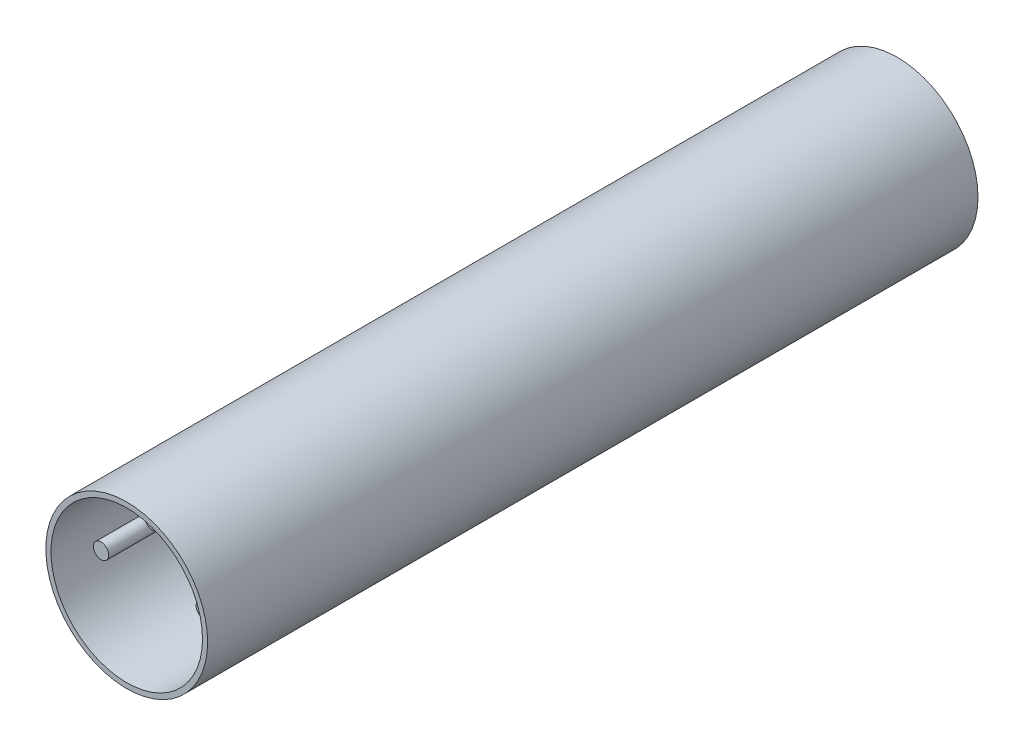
from build123d import *

# Parameters (mm, degrees)
SKETCH1_R          = 4.0005
EXTRUDE1_DEPTH     = 38.1
SKETCH2_R          = 3.7465
CUT_EXTRUDE1_DEPTH = 6.35
SKETCH3_R          = 0.381
EXTRUDE2_DEPTH     = 5.08
EXTRUDE2_2_DEPTH   = 5.08
EXTRUDE2_3_DEPTH   = 5.08


with BuildPart() as part:
    # Sketch1 → Extrude1 (new body)
    with BuildSketch(Plane.XY):
        Circle(SKETCH1_R)
    extrude(amount=-EXTRUDE1_DEPTH)

    # Sketch2 → Cut-Extrude1 (cut)
    with BuildSketch(Plane.XY):
        Circle(SKETCH2_R)
    extrude(amount=-CUT_EXTRUDE1_DEPTH, mode=Mode.SUBTRACT)


with BuildPart() as body_2:
    # Sketch3 → Extrude2 (new body)
    with BuildSketch(Plane.XY.offset(-6.35)):
        with Locations((0, 2.54)):
            Circle(SKETCH3_R)
    extrude(amount=EXTRUDE2_DEPTH)


with BuildPart() as body_3:
    # Sketch3 → Extrude2 2 (new body)
    with BuildSketch(Plane.XY.offset(-6.35)):
        with Locations((2.54, 0)):
            Circle(SKETCH3_R)
    extrude(amount=EXTRUDE2_2_DEPTH)


with BuildPart() as body_4:
    # Sketch3 → Extrude2 3 (new body)
    with BuildSketch(Plane.XY.offset(-6.35)):
        with Locations(Location((-2.54, 0, 0), (0, 0, 180))):
            Circle(SKETCH3_R)
    extrude(amount=EXTRUDE2_3_DEPTH)


solid = Compound([part.part, body_2.part, body_3.part, body_4.part])
